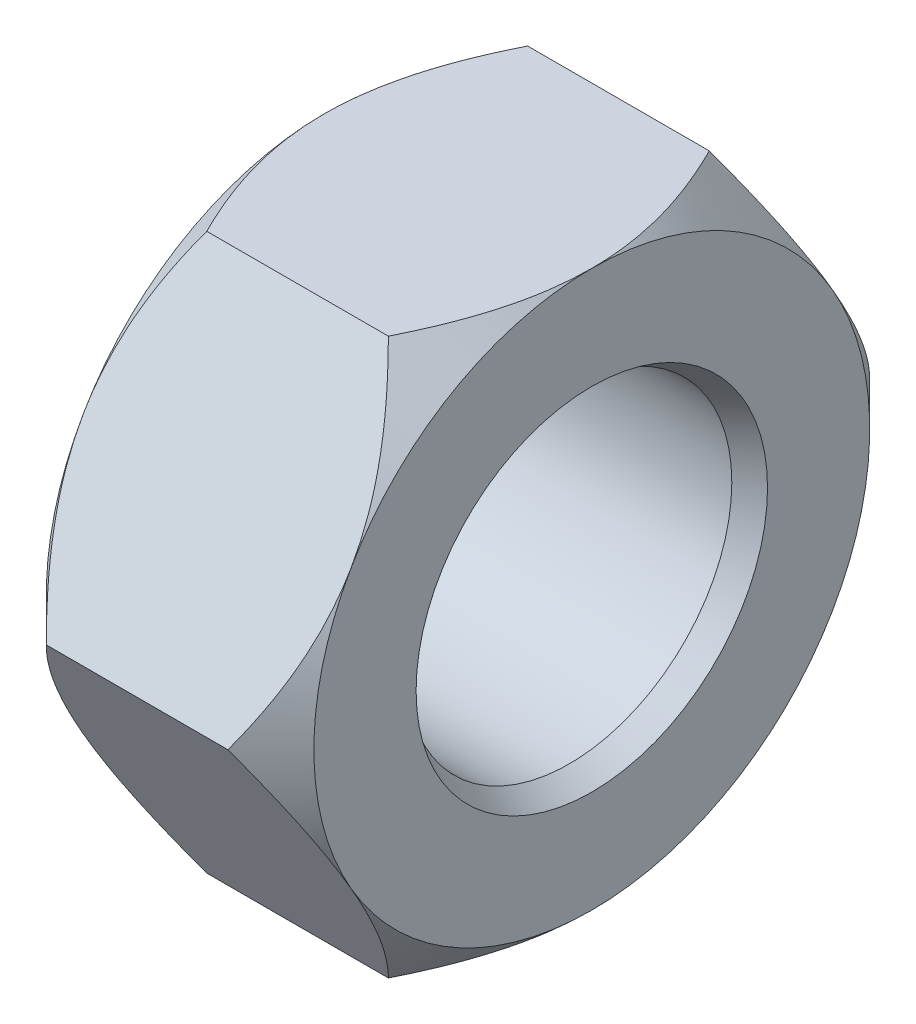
ISO-10303-21;
HEADER;
FILE_DESCRIPTION(('STEP AP214'),'2;1');
FILE_NAME('part.step','',(''),(''),'','','');
FILE_SCHEMA(('AUTOMOTIVE_DESIGN { 1 0 10303 214 1 1 1 1 }'));
ENDSEC;
DATA;
#1=APPLICATION_CONTEXT('core data for automotive mechanical design processes');
#2=APPLICATION_PROTOCOL_DEFINITION('international standard','automotive_design',2000,#1);
#3=PRODUCT_CONTEXT('',#1,'mechanical');
#4=PRODUCT('Part','Part','',(#3));
#5=PRODUCT_RELATED_PRODUCT_CATEGORY('part','',(#4));
#6=PRODUCT_DEFINITION_FORMATION('','',#4);
#7=PRODUCT_DEFINITION_CONTEXT('part definition',#1,'design');
#8=PRODUCT_DEFINITION('design','',#6,#7);
#9=PRODUCT_DEFINITION_SHAPE('','',#8);
#10=(LENGTH_UNIT() NAMED_UNIT(*) SI_UNIT(.MILLI.,.METRE.));
#11=(NAMED_UNIT(*) PLANE_ANGLE_UNIT() SI_UNIT($,.RADIAN.));
#12=(NAMED_UNIT(*) SI_UNIT($,.STERADIAN.) SOLID_ANGLE_UNIT());
#13=UNCERTAINTY_MEASURE_WITH_UNIT(LENGTH_MEASURE(1.E-05),#10,'distance_accuracy_value','');
#14=(GEOMETRIC_REPRESENTATION_CONTEXT(3) GLOBAL_UNCERTAINTY_ASSIGNED_CONTEXT((#13)) GLOBAL_UNIT_ASSIGNED_CONTEXT((#10,
#11,#12)) REPRESENTATION_CONTEXT('',''));
#15=CARTESIAN_POINT('',(0.,0.,0.));
#16=DIRECTION('',(0.,0.,1.));
#17=DIRECTION('',(1.,0.,0.));
#18=AXIS2_PLACEMENT_3D('',#15,#16,#17);
#19=CARTESIAN_POINT('',(5.00000000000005,0.,0.));
#20=DIRECTION('',(1.,0.,0.));
#21=DIRECTION('',(0.,0.,-1.));
#22=AXIS2_PLACEMENT_3D('',#19,#20,#21);
#23=CONICAL_SURFACE('',#22,18.5,0.785398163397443);
#24=CARTESIAN_POINT('',(8.57500740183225,-13.5,-17.4658510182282));
#25=CARTESIAN_POINT('',(8.40975452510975,-13.5,-17.2569852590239));
#26=CARTESIAN_POINT('',(8.24518004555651,-13.5,-17.0475831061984));
#27=CARTESIAN_POINT('',(7.9175209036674,-13.5,-16.6276118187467));
#28=CARTESIAN_POINT('',(7.75443626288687,-13.5,-16.4170426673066));
#29=CARTESIAN_POINT('',(7.26755832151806,-13.5,-15.7833673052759));
#30=CARTESIAN_POINT('',(6.94620776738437,-13.5,-15.358377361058));
#31=CARTESIAN_POINT('',(6.30897522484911,-13.5,-14.499281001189));
#32=CARTESIAN_POINT('',(5.99315346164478,-13.5,-14.0651298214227));
#33=CARTESIAN_POINT('',(5.37134468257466,-13.5,-13.1898645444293));
#34=CARTESIAN_POINT('',(5.06535701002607,-13.5,-12.7487509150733));
#35=CARTESIAN_POINT('',(4.44332117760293,-13.5,-11.8253043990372));
#36=CARTESIAN_POINT('',(4.12820744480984,-13.5,-11.3423390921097));
#37=CARTESIAN_POINT('',(3.51583266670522,-13.5,-10.3650217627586));
#38=CARTESIAN_POINT('',(3.21857490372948,-13.5,-9.87066766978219));
#39=CARTESIAN_POINT('',(2.64810934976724,-13.5,-8.87016835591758));
#40=CARTESIAN_POINT('',(2.37483154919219,-13.5,-8.36406331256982));
#41=CARTESIAN_POINT('',(1.85841694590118,-13.5,-7.33675869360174));
#42=CARTESIAN_POINT('',(1.61526507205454,-13.5,-6.81556682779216));
#43=CARTESIAN_POINT('',(1.29391852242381,-13.5,-6.05425939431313));
#44=CARTESIAN_POINT('',(1.19982775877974,-13.5,-5.82082745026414));
#45=CARTESIAN_POINT('',(1.02010004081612,-13.5,-5.35075169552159));
#46=CARTESIAN_POINT('',(0.934462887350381,-13.5,-5.11410796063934));
#47=CARTESIAN_POINT('',(0.691640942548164,-13.5,-4.39923792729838));
#48=CARTESIAN_POINT('',(0.548527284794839,-13.5,-3.91603009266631));
#49=CARTESIAN_POINT('',(0.369388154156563,-13.5,-3.18807150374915));
#50=CARTESIAN_POINT('',(0.31598901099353,-13.5,-2.94750401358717));
#51=CARTESIAN_POINT('',(0.220986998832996,-13.5,-2.46406209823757));
#52=CARTESIAN_POINT('',(0.179382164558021,-13.5,-2.22118806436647));
#53=CARTESIAN_POINT('',(0.108723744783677,-13.5,-1.73364747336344));
#54=CARTESIAN_POINT('',(0.0796685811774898,-13.5,-1.48898114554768));
#55=CARTESIAN_POINT('',(0.0346683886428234,-13.5,-0.998441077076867));
#56=CARTESIAN_POINT('',(0.0187230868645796,-13.5,-0.752567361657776));
#57=CARTESIAN_POINT('',(0.000804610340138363,-13.5,-0.274603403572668));
#58=CARTESIAN_POINT('',(-0.00192574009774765,-13.5,-0.0425413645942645));
#59=CARTESIAN_POINT('',(0.00458421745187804,-13.5,0.421440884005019));
#60=CARTESIAN_POINT('',(0.0138258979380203,-13.5,0.653361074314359));
#61=CARTESIAN_POINT('',(0.0441136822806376,-13.5,1.11641132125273));
#62=CARTESIAN_POINT('',(0.0651588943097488,-13.5,1.34754143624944));
#63=CARTESIAN_POINT('',(0.118669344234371,-13.5,1.80848735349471));
#64=CARTESIAN_POINT('',(0.151136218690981,-13.5,2.03830296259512));
#65=CARTESIAN_POINT('',(0.266335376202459,-13.5,2.73372438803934));
#66=CARTESIAN_POINT('',(0.366268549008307,-13.5,3.19656045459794));
#67=CARTESIAN_POINT('',(0.605339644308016,-13.5,4.11171328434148));
#68=CARTESIAN_POINT('',(0.74447721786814,-13.5,4.5640301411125));
#69=CARTESIAN_POINT('',(1.05699331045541,-13.5,5.46217190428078));
#70=CARTESIAN_POINT('',(1.230734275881,-13.5,5.90786927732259));
#71=CARTESIAN_POINT('',(1.6051849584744,-13.5,6.78788106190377));
#72=CARTESIAN_POINT('',(1.80590636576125,-13.5,7.22219044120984));
#73=CARTESIAN_POINT('',(2.22956318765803,-13.5,8.08141605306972));
#74=CARTESIAN_POINT('',(2.45256527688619,-13.5,8.50629914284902));
#75=CARTESIAN_POINT('',(2.91590033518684,-13.5,9.3463635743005));
#76=CARTESIAN_POINT('',(3.15623073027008,-13.5,9.76154634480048));
#77=CARTESIAN_POINT('',(3.63866389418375,-13.5,10.5631964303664));
#78=CARTESIAN_POINT('',(3.88009486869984,-13.5,10.950070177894));
#79=CARTESIAN_POINT('',(4.37332688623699,-13.5,11.7171692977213));
#80=CARTESIAN_POINT('',(4.62512869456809,-13.5,12.0973941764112));
#81=CARTESIAN_POINT('',(5.13523905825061,-13.5,12.8490412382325));
#82=CARTESIAN_POINT('',(5.39348026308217,-13.5,13.2205092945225));
#83=CARTESIAN_POINT('',(5.9169572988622,-13.5,13.9583359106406));
#84=CARTESIAN_POINT('',(6.18219118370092,-13.5,14.3246958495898));
#85=CARTESIAN_POINT('',(6.45029006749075,-13.5,14.688909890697));
#86=B_SPLINE_CURVE_WITH_KNOTS('',3,(#24,#25,#26,#27,#28,#29,#30,#31,#32,#33,#34,#35,#36,#37,#38,
#39,#40,#41,#42,#43,#44,#45,#46,#47,#48,#49,#50,#51,#52,#53,#54,#55,#56,#57,#58,#59,#60,#61,#62,
#63,#64,#65,#66,#67,#68,#69,#70,#71,#72,#73,#74,#75,#76,#77,#78,#79,#80,#81,#82,#83,#84,#85),
.UNSPECIFIED.,.F.,.F.,(4,2,2,2,2,2,2,2,2,2,2,2,2,2,2,2,2,2,2,2,2,2,2,2,2,2,2,2,2,2,4),(0.,
0.798997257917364,1.59800605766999,3.19634593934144,4.80684908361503,6.41724446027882,
8.1469605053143,9.87699354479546,11.6017949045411,13.3257298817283,14.0806257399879,
14.8355038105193,16.3451207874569,17.0841571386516,17.8230702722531,18.5618904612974,
19.300695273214,19.9966230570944,20.6926306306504,21.3885856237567,22.084640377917,
23.5029302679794,24.9212075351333,26.3552056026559,27.7898270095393,29.2288779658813,
30.6677156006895,32.0356018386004,33.4035892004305,34.7607391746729,36.1175153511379),.UNSPECIFIED.);
#87=CARTESIAN_POINT('',(2.08845726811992,-13.5,7.79422863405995));
#88=VERTEX_POINT('',#87);
#89=CARTESIAN_POINT('',(0.,-13.5,0.));
#90=VERTEX_POINT('',#89);
#91=EDGE_CURVE('E289',#88,#90,#86,.F.);
#92=ORIENTED_EDGE('',*,*,#91,.F.);
#93=CARTESIAN_POINT('',(2.08857273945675,0.000200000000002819,15.5885727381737));
#94=CARTESIAN_POINT('',(1.954593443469,-0.231893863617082,15.4545732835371));
#95=CARTESIAN_POINT('',(1.82470250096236,-0.465805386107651,15.3195244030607));
#96=CARTESIAN_POINT('',(1.57439597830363,-0.937546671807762,15.0471644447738));
#97=CARTESIAN_POINT('',(1.4539855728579,-1.17537849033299,14.9098521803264));
#98=CARTESIAN_POINT('',(1.22342885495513,-1.65636502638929,14.6321544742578));
#99=CARTESIAN_POINT('',(1.11334525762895,-1.89954242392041,14.4917559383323));
#100=CARTESIAN_POINT('',(0.90583303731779,-2.3898912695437,14.2086529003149));
#101=CARTESIAN_POINT('',(0.808402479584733,-2.6370621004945,14.0659487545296));
#102=CARTESIAN_POINT('',(0.629279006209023,-3.13142378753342,13.7805289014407));
#103=CARTESIAN_POINT('',(0.547363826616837,-3.37855389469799,13.6378482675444));
#104=CARTESIAN_POINT('',(0.399063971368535,-3.87627837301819,13.3504869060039));
#105=CARTESIAN_POINT('',(0.332677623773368,-4.12687236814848,13.2058063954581));
#106=CARTESIAN_POINT('',(0.217106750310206,-4.63045277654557,12.9150641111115));
#107=CARTESIAN_POINT('',(0.167883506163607,-4.88343246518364,12.7690062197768));
#108=CARTESIAN_POINT('',(0.0877204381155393,-5.39151563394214,12.4756642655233));
#109=CARTESIAN_POINT('',(0.056777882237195,-5.64661879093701,12.3283803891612));
#110=CARTESIAN_POINT('',(0.0048957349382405,-6.26828700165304,11.9694600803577));
#111=CARTESIAN_POINT('',(-0.00599145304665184,-6.63552399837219,11.7574357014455));
#112=CARTESIAN_POINT('',(0.0122840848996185,-7.3693337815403,11.3337704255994));
#113=CARTESIAN_POINT('',(0.0414608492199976,-7.7359062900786,11.1221296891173));
#114=CARTESIAN_POINT('',(0.138142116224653,-8.46559576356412,10.7008432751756));
#115=CARTESIAN_POINT('',(0.205689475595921,-8.82870840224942,10.4912000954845));
#116=CARTESIAN_POINT('',(0.375440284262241,-9.5486924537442,10.0755171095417));
#117=CARTESIAN_POINT('',(0.477641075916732,-9.90556434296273,9.8694770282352));
#118=CARTESIAN_POINT('',(0.687891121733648,-10.5390522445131,9.50373261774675));
#119=CARTESIAN_POINT('',(0.790409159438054,-10.8170714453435,9.3432181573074));
#120=CARTESIAN_POINT('',(1.01196439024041,-11.3681194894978,9.0250704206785));
#121=CARTESIAN_POINT('',(1.13100208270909,-11.6411481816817,8.86743723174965));
#122=CARTESIAN_POINT('',(1.38292856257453,-12.1813552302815,8.5555485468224));
#123=CARTESIAN_POINT('',(1.51577378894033,-12.4485489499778,8.40128418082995));
#124=CARTESIAN_POINT('',(1.79357153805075,-12.9779891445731,8.0956117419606));
#125=CARTESIAN_POINT('',(1.93851663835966,-13.2402385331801,7.94420198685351));
#126=CARTESIAN_POINT('',(2.08857273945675,-13.5002,7.79411316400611));
#127=B_SPLINE_CURVE_WITH_KNOTS('',3,(#93,#94,#95,#96,#97,#98,#99,#100,#101,#102,#103,#104,#105,
#106,#107,#108,#109,#110,#111,#112,#113,#114,#115,#116,#117,#118,#119,#120,#121,#122,#123,#124,
#125,#126),.UNSPECIFIED.,.F.,.F.,(4,2,2,2,2,2,2,2,2,2,2,2,2,2,2,2,4),(0.,0.898906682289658,
1.79830065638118,2.70284417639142,3.60724922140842,4.49751224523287,5.38767937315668,
6.27582517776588,7.16383821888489,8.4344203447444,9.70544779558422,10.9778976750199,
12.2502499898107,13.2607780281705,14.2713366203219,15.278798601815,16.2856470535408),.UNSPECIFIED.);
#128=CARTESIAN_POINT('',(0.,-6.75,11.6913429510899));
#129=VERTEX_POINT('',#128);
#130=EDGE_CURVE('E152',#129,#88,#127,.T.);
#131=ORIENTED_EDGE('',*,*,#130,.F.);
#132=CARTESIAN_POINT('',(0.,0.,0.));
#133=DIRECTION('',(-1.,0.,0.));
#134=DIRECTION('',(0.,0.,1.));
#135=AXIS2_PLACEMENT_3D('',#132,#133,#134);
#136=CIRCLE('',#135,13.5);
#137=EDGE_CURVE('E288',#90,#129,#136,.T.);
#138=ORIENTED_EDGE('',*,*,#137,.F.);
#139=EDGE_LOOP('',(#92,#131,#138));
#140=FACE_BOUND('',#139,.T.);
#141=ADVANCED_FACE('F33',(#140),#23,.T.);
#142=CARTESIAN_POINT('',(2.08845726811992,-13.5,-7.79422863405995));
#143=VERTEX_POINT('',#142);
#144=EDGE_CURVE('E209',#90,#143,#86,.F.);
#145=ORIENTED_EDGE('',*,*,#144,.F.);
#146=CARTESIAN_POINT('',(0.,-6.75,-11.6913429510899));
#147=VERTEX_POINT('',#146);
#148=EDGE_CURVE('E212',#147,#90,#136,.T.);
#149=ORIENTED_EDGE('',*,*,#148,.F.);
#150=CARTESIAN_POINT('',(2.08857273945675,-13.5002,-7.79411316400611));
#151=CARTESIAN_POINT('',(1.95459344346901,-13.2681061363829,-7.9281126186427));
#152=CARTESIAN_POINT('',(1.82470250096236,-13.0341946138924,-8.06316149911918));
#153=CARTESIAN_POINT('',(1.57439597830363,-12.5624533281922,-8.335521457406));
#154=CARTESIAN_POINT('',(1.4539855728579,-12.324621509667,-8.4728337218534));
#155=CARTESIAN_POINT('',(1.22342885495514,-11.8436349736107,-8.75053142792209));
#156=CARTESIAN_POINT('',(1.11334525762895,-11.6004575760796,-8.89092996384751));
#157=CARTESIAN_POINT('',(0.905833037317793,-11.1101087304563,-9.17403300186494));
#158=CARTESIAN_POINT('',(0.808402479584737,-10.8629378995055,-9.31673714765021));
#159=CARTESIAN_POINT('',(0.629279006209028,-10.3685762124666,-9.60215700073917));
#160=CARTESIAN_POINT('',(0.547363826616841,-10.121446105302,-9.74483763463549));
#161=CARTESIAN_POINT('',(0.399063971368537,-9.62372162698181,-10.0321989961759));
#162=CARTESIAN_POINT('',(0.332677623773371,-9.37312763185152,-10.1768795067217));
#163=CARTESIAN_POINT('',(0.21710675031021,-8.86954722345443,-10.4676217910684));
#164=CARTESIAN_POINT('',(0.167883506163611,-8.61656753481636,-10.6136796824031));
#165=CARTESIAN_POINT('',(0.0877204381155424,-8.10848436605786,-10.9070216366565));
#166=CARTESIAN_POINT('',(0.0567778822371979,-7.85338120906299,-11.0543055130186));
#167=CARTESIAN_POINT('',(0.00489573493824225,-7.23171299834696,-11.4132258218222));
#168=CARTESIAN_POINT('',(-0.00599145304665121,-6.86447600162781,-11.6252502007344));
#169=CARTESIAN_POINT('',(0.0122840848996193,-6.13066621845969,-12.0489154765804));
#170=CARTESIAN_POINT('',(0.0414608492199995,-5.7640937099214,-12.2605562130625));
#171=CARTESIAN_POINT('',(0.138142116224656,-5.03440423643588,-12.6818426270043));
#172=CARTESIAN_POINT('',(0.205689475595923,-4.67129159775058,-12.8914858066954));
#173=CARTESIAN_POINT('',(0.375440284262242,-3.9513075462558,-13.3071687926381));
#174=CARTESIAN_POINT('',(0.477641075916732,-3.59443565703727,-13.5132088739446));
#175=CARTESIAN_POINT('',(0.687891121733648,-2.96094775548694,-13.8789532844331));
#176=CARTESIAN_POINT('',(0.790409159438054,-2.68292855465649,-14.0394677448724));
#177=CARTESIAN_POINT('',(1.01196439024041,-2.13188051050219,-14.3576154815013));
#178=CARTESIAN_POINT('',(1.13100208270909,-1.85885181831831,-14.5152486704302));
#179=CARTESIAN_POINT('',(1.38292856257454,-1.31864476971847,-14.8271373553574));
#180=CARTESIAN_POINT('',(1.51577378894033,-1.05145105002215,-14.9814017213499));
#181=CARTESIAN_POINT('',(1.79357153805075,-0.52201085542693,-15.2870741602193));
#182=CARTESIAN_POINT('',(1.93851663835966,-0.259761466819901,-15.4384839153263));
#183=CARTESIAN_POINT('',(2.08857273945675,0.000200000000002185,-15.5885727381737));
#184=B_SPLINE_CURVE_WITH_KNOTS('',3,(#150,#151,#152,#153,#154,#155,#156,#157,#158,#159,#160,
#161,#162,#163,#164,#165,#166,#167,#168,#169,#170,#171,#172,#173,#174,#175,#176,#177,#178,#179,
#180,#181,#182,#183),.UNSPECIFIED.,.F.,.F.,(4,2,2,2,2,2,2,2,2,2,2,2,2,2,2,2,4),(0.,
0.898906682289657,1.79830065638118,2.70284417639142,3.60724922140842,4.49751224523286,
5.38767937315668,6.27582517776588,7.16383821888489,8.43442034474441,9.70544779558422,
10.9778976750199,12.2502499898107,13.2607780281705,14.2713366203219,15.278798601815,
16.2856470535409),.UNSPECIFIED.);
#185=EDGE_CURVE('E199',#143,#147,#184,.T.);
#186=ORIENTED_EDGE('',*,*,#185,.F.);
#187=EDGE_LOOP('',(#145,#149,#186));
#188=FACE_BOUND('',#187,.T.);
#189=ADVANCED_FACE('F208',(#188),#23,.T.);
#190=CARTESIAN_POINT('',(2.08845726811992,0.,-15.5884572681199));
#191=VERTEX_POINT('',#190);
#192=EDGE_CURVE('E215',#147,#191,#184,.T.);
#193=ORIENTED_EDGE('',*,*,#192,.F.);
#194=CARTESIAN_POINT('',(0.,6.75,-11.6913429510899));
#195=VERTEX_POINT('',#194);
#196=EDGE_CURVE('E297',#195,#147,#136,.T.);
#197=ORIENTED_EDGE('',*,*,#196,.F.);
#198=CARTESIAN_POINT('',(2.08857273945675,-0.000199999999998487,-15.5885727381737));
#199=CARTESIAN_POINT('',(1.95459344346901,0.231893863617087,-15.4545732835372));
#200=CARTESIAN_POINT('',(1.82470250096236,0.465805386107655,-15.3195244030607));
#201=CARTESIAN_POINT('',(1.57439597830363,0.937546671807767,-15.0471644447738));
#202=CARTESIAN_POINT('',(1.4539855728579,1.175378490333,-14.9098521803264));
#203=CARTESIAN_POINT('',(1.22342885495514,1.65636502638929,-14.6321544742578));
#204=CARTESIAN_POINT('',(1.11334525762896,1.89954242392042,-14.4917559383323));
#205=CARTESIAN_POINT('',(0.905833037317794,2.3898912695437,-14.2086529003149));
#206=CARTESIAN_POINT('',(0.808402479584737,2.6370621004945,-14.0659487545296));
#207=CARTESIAN_POINT('',(0.629279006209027,3.13142378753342,-13.7805289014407));
#208=CARTESIAN_POINT('',(0.547363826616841,3.37855389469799,-13.6378482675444));
#209=CARTESIAN_POINT('',(0.399063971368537,3.87627837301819,-13.3504869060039));
#210=CARTESIAN_POINT('',(0.33267762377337,4.12687236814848,-13.2058063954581));
#211=CARTESIAN_POINT('',(0.217106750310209,4.63045277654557,-12.9150641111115));
#212=CARTESIAN_POINT('',(0.167883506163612,4.88343246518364,-12.7690062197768));
#213=CARTESIAN_POINT('',(0.087720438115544,5.39151563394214,-12.4756642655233));
#214=CARTESIAN_POINT('',(0.0567778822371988,5.64661879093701,-12.3283803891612));
#215=CARTESIAN_POINT('',(0.00489573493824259,6.26828700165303,-11.9694600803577));
#216=CARTESIAN_POINT('',(-0.00599145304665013,6.63552399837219,-11.7574357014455));
#217=CARTESIAN_POINT('',(0.0122840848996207,7.3693337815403,-11.3337704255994));
#218=CARTESIAN_POINT('',(0.0414608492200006,7.73590629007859,-11.1221296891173));
#219=CARTESIAN_POINT('',(0.138142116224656,8.46559576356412,-10.7008432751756));
#220=CARTESIAN_POINT('',(0.205689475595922,8.82870840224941,-10.4912000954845));
#221=CARTESIAN_POINT('',(0.37544028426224,9.5486924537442,-10.0755171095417));
#222=CARTESIAN_POINT('',(0.477641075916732,9.90556434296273,-9.86947702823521));
#223=CARTESIAN_POINT('',(0.687891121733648,10.5390522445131,-9.50373261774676));
#224=CARTESIAN_POINT('',(0.790409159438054,10.8170714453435,-9.34321815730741));
#225=CARTESIAN_POINT('',(1.01196439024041,11.3681194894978,-9.02507042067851));
#226=CARTESIAN_POINT('',(1.13100208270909,11.6411481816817,-8.86743723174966));
#227=CARTESIAN_POINT('',(1.38292856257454,12.1813552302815,-8.5555485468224));
#228=CARTESIAN_POINT('',(1.51577378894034,12.4485489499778,-8.40128418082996));
#229=CARTESIAN_POINT('',(1.79357153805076,12.9779891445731,-8.0956117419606));
#230=CARTESIAN_POINT('',(1.93851663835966,13.2402385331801,-7.94420198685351));
#231=CARTESIAN_POINT('',(2.08857273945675,13.5002,-7.79411316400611));
#232=B_SPLINE_CURVE_WITH_KNOTS('',3,(#198,#199,#200,#201,#202,#203,#204,#205,#206,#207,#208,
#209,#210,#211,#212,#213,#214,#215,#216,#217,#218,#219,#220,#221,#222,#223,#224,#225,#226,#227,
#228,#229,#230,#231),.UNSPECIFIED.,.F.,.F.,(4,2,2,2,2,2,2,2,2,2,2,2,2,2,2,2,4),(0.,
0.898906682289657,1.79830065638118,2.70284417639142,3.60724922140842,4.49751224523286,
5.38767937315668,6.27582517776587,7.16383821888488,8.43442034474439,9.70544779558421,
10.9778976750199,12.2502499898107,13.2607780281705,14.2713366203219,15.278798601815,
16.2856470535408),.UNSPECIFIED.);
#233=EDGE_CURVE('E252',#191,#195,#232,.T.);
#234=ORIENTED_EDGE('',*,*,#233,.F.);
#235=EDGE_LOOP('',(#193,#197,#234));
#236=FACE_BOUND('',#235,.T.);
#237=ADVANCED_FACE('F355',(#236),#23,.T.);
#238=CARTESIAN_POINT('',(2.08845726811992,13.5,-7.79422863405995));
#239=VERTEX_POINT('',#238);
#240=EDGE_CURVE('E248',#195,#239,#232,.T.);
#241=ORIENTED_EDGE('',*,*,#240,.F.);
#242=CARTESIAN_POINT('',(0.,13.5,0.));
#243=VERTEX_POINT('',#242);
#244=EDGE_CURVE('E293',#243,#195,#136,.T.);
#245=ORIENTED_EDGE('',*,*,#244,.F.);
#246=CARTESIAN_POINT('',(8.57500740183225,13.5,-17.4658510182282));
#247=CARTESIAN_POINT('',(8.40975452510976,13.5,-17.2569852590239));
#248=CARTESIAN_POINT('',(8.24518004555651,13.5,-17.0475831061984));
#249=CARTESIAN_POINT('',(7.9175209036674,13.5,-16.6276118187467));
#250=CARTESIAN_POINT('',(7.75443626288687,13.5,-16.4170426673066));
#251=CARTESIAN_POINT('',(7.26755832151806,13.5,-15.7833673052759));
#252=CARTESIAN_POINT('',(6.94620776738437,13.5,-15.358377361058));
#253=CARTESIAN_POINT('',(6.30897522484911,13.5,-14.499281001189));
#254=CARTESIAN_POINT('',(5.99315346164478,13.5,-14.0651298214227));
#255=CARTESIAN_POINT('',(5.37134468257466,13.5,-13.1898645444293));
#256=CARTESIAN_POINT('',(5.06535701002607,13.5,-12.7487509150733));
#257=CARTESIAN_POINT('',(4.44332117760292,13.5,-11.8253043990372));
#258=CARTESIAN_POINT('',(4.12820744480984,13.5,-11.3423390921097));
#259=CARTESIAN_POINT('',(3.51583266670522,13.5,-10.3650217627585));
#260=CARTESIAN_POINT('',(3.21857490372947,13.5,-9.87066766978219));
#261=CARTESIAN_POINT('',(2.64810934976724,13.5,-8.87016835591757));
#262=CARTESIAN_POINT('',(2.37483154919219,13.5,-8.36406331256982));
#263=CARTESIAN_POINT('',(1.85841694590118,13.5,-7.33675869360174));
#264=CARTESIAN_POINT('',(1.61526507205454,13.5,-6.81556682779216));
#265=CARTESIAN_POINT('',(1.29391852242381,13.5,-6.05425939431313));
#266=CARTESIAN_POINT('',(1.19982775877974,13.5,-5.82082745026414));
#267=CARTESIAN_POINT('',(1.02010004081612,13.5,-5.35075169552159));
#268=CARTESIAN_POINT('',(0.934462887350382,13.5,-5.11410796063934));
#269=CARTESIAN_POINT('',(0.691640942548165,13.5,-4.39923792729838));
#270=CARTESIAN_POINT('',(0.548527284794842,13.5,-3.91603009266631));
#271=CARTESIAN_POINT('',(0.369388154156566,13.5,-3.18807150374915));
#272=CARTESIAN_POINT('',(0.315989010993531,13.5,-2.94750401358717));
#273=CARTESIAN_POINT('',(0.220986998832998,13.5,-2.46406209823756));
#274=CARTESIAN_POINT('',(0.179382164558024,13.5,-2.22118806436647));
#275=CARTESIAN_POINT('',(0.10872374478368,13.5,-1.73364747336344));
#276=CARTESIAN_POINT('',(0.0796685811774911,13.5,-1.48898114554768));
#277=CARTESIAN_POINT('',(0.0346683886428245,13.5,-0.998441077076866));
#278=CARTESIAN_POINT('',(0.0187230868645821,13.5,-0.752567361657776));
#279=CARTESIAN_POINT('',(0.000804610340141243,13.5,-0.274603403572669));
#280=CARTESIAN_POINT('',(-0.00192574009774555,13.5,-0.0425413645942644));
#281=CARTESIAN_POINT('',(0.00458421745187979,13.5,0.421440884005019));
#282=CARTESIAN_POINT('',(0.0138258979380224,13.5,0.653361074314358));
#283=CARTESIAN_POINT('',(0.0441136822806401,13.5,1.11641132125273));
#284=CARTESIAN_POINT('',(0.0651588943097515,13.5,1.34754143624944));
#285=CARTESIAN_POINT('',(0.118669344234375,13.5,1.80848735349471));
#286=CARTESIAN_POINT('',(0.151136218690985,13.5,2.03830296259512));
#287=CARTESIAN_POINT('',(0.266335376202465,13.5,2.73372438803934));
#288=CARTESIAN_POINT('',(0.366268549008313,13.5,3.19656045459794));
#289=CARTESIAN_POINT('',(0.605339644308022,13.5,4.11171328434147));
#290=CARTESIAN_POINT('',(0.744477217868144,13.5,4.5640301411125));
#291=CARTESIAN_POINT('',(1.05699331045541,13.5,5.46217190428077));
#292=CARTESIAN_POINT('',(1.23073427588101,13.5,5.90786927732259));
#293=CARTESIAN_POINT('',(1.6051849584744,13.5,6.78788106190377));
#294=CARTESIAN_POINT('',(1.80590636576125,13.5,7.22219044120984));
#295=CARTESIAN_POINT('',(2.22956318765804,13.5,8.08141605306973));
#296=CARTESIAN_POINT('',(2.45256527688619,13.5,8.50629914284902));
#297=CARTESIAN_POINT('',(2.91590033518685,13.5,9.3463635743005));
#298=CARTESIAN_POINT('',(3.15623073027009,13.5,9.76154634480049));
#299=CARTESIAN_POINT('',(3.63866389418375,13.5,10.5631964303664));
#300=CARTESIAN_POINT('',(3.88009486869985,13.5,10.950070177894));
#301=CARTESIAN_POINT('',(4.373326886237,13.5,11.7171692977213));
#302=CARTESIAN_POINT('',(4.62512869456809,13.5,12.0973941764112));
#303=CARTESIAN_POINT('',(5.13523905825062,13.5,12.8490412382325));
#304=CARTESIAN_POINT('',(5.39348026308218,13.5,13.2205092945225));
#305=CARTESIAN_POINT('',(5.91695729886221,13.5,13.9583359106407));
#306=CARTESIAN_POINT('',(6.18219118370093,13.5,14.3246958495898));
#307=CARTESIAN_POINT('',(6.45029006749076,13.5,14.688909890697));
#308=B_SPLINE_CURVE_WITH_KNOTS('',3,(#246,#247,#248,#249,#250,#251,#252,#253,#254,#255,#256,
#257,#258,#259,#260,#261,#262,#263,#264,#265,#266,#267,#268,#269,#270,#271,#272,#273,#274,#275,
#276,#277,#278,#279,#280,#281,#282,#283,#284,#285,#286,#287,#288,#289,#290,#291,#292,#293,#294,
#295,#296,#297,#298,#299,#300,#301,#302,#303,#304,#305,#306,#307),.UNSPECIFIED.,.F.,.F.,(4,2,2,
2,2,2,2,2,2,2,2,2,2,2,2,2,2,2,2,2,2,2,2,2,2,2,2,2,2,2,4),(0.,0.798997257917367,1.59800605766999,
3.19634593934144,4.80684908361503,6.41724446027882,8.14696050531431,9.87699354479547,
11.6017949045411,13.3257298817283,14.0806257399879,14.8355038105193,16.3451207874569,
17.0841571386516,17.8230702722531,18.5618904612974,19.300695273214,19.9966230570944,
20.6926306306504,21.3885856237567,22.084640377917,23.5029302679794,24.9212075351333,
26.3552056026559,27.7898270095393,29.2288779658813,30.6677156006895,32.0356018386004,
33.4035892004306,34.7607391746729,36.1175153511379),.UNSPECIFIED.);
#309=EDGE_CURVE('E258',#239,#243,#308,.T.);
#310=ORIENTED_EDGE('',*,*,#309,.F.);
#311=EDGE_LOOP('',(#241,#245,#310));
#312=FACE_BOUND('',#311,.T.);
#313=ADVANCED_FACE('F357',(#312),#23,.T.);
#314=CARTESIAN_POINT('',(2.08845726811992,13.5,7.79422863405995));
#315=VERTEX_POINT('',#314);
#316=EDGE_CURVE('E260',#243,#315,#308,.T.);
#317=ORIENTED_EDGE('',*,*,#316,.F.);
#318=CARTESIAN_POINT('',(0.,6.75,11.6913429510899));
#319=VERTEX_POINT('',#318);
#320=EDGE_CURVE('E287',#319,#243,#136,.T.);
#321=ORIENTED_EDGE('',*,*,#320,.F.);
#322=CARTESIAN_POINT('',(2.08857273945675,13.5002,7.79411316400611));
#323=CARTESIAN_POINT('',(1.95459344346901,13.2681061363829,7.9281126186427));
#324=CARTESIAN_POINT('',(1.82470250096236,13.0341946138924,8.06316149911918));
#325=CARTESIAN_POINT('',(1.57439597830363,12.5624533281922,8.335521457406));
#326=CARTESIAN_POINT('',(1.4539855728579,12.324621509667,8.4728337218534));
#327=CARTESIAN_POINT('',(1.22342885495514,11.8436349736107,8.75053142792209));
#328=CARTESIAN_POINT('',(1.11334525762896,11.6004575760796,8.89092996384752));
#329=CARTESIAN_POINT('',(0.905833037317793,11.1101087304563,9.17403300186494));
#330=CARTESIAN_POINT('',(0.808402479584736,10.8629378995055,9.31673714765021));
#331=CARTESIAN_POINT('',(0.629279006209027,10.3685762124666,9.60215700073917));
#332=CARTESIAN_POINT('',(0.54736382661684,10.121446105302,9.74483763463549));
#333=CARTESIAN_POINT('',(0.399063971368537,9.62372162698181,10.0321989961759));
#334=CARTESIAN_POINT('',(0.33267762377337,9.37312763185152,10.1768795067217));
#335=CARTESIAN_POINT('',(0.21710675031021,8.86954722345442,10.4676217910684));
#336=CARTESIAN_POINT('',(0.167883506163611,8.61656753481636,10.6136796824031));
#337=CARTESIAN_POINT('',(0.0877204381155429,8.10848436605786,10.9070216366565));
#338=CARTESIAN_POINT('',(0.0567778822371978,7.85338120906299,11.0543055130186));
#339=CARTESIAN_POINT('',(0.0048957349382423,7.23171299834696,11.4132258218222));
#340=CARTESIAN_POINT('',(-0.00599145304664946,6.8644760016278,11.6252502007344));
#341=CARTESIAN_POINT('',(0.0122840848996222,6.13066621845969,12.0489154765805));
#342=CARTESIAN_POINT('',(0.0414608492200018,5.7640937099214,12.2605562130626));
#343=CARTESIAN_POINT('',(0.138142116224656,5.03440423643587,12.6818426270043));
#344=CARTESIAN_POINT('',(0.205689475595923,4.67129159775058,12.8914858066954));
#345=CARTESIAN_POINT('',(0.375440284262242,3.95130754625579,13.3071687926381));
#346=CARTESIAN_POINT('',(0.477641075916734,3.59443565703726,13.5132088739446));
#347=CARTESIAN_POINT('',(0.687891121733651,2.96094775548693,13.8789532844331));
#348=CARTESIAN_POINT('',(0.790409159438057,2.68292855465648,14.0394677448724));
#349=CARTESIAN_POINT('',(1.01196439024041,2.13188051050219,14.3576154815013));
#350=CARTESIAN_POINT('',(1.13100208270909,1.85885181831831,14.5152486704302));
#351=CARTESIAN_POINT('',(1.38292856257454,1.31864476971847,14.8271373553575));
#352=CARTESIAN_POINT('',(1.51577378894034,1.05145105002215,14.9814017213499));
#353=CARTESIAN_POINT('',(1.79357153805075,0.522010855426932,15.2870741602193));
#354=CARTESIAN_POINT('',(1.93851663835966,0.259761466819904,15.4384839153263));
#355=CARTESIAN_POINT('',(2.08857273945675,-0.000199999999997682,15.5885727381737));
#356=B_SPLINE_CURVE_WITH_KNOTS('',3,(#322,#323,#324,#325,#326,#327,#328,#329,#330,#331,#332,
#333,#334,#335,#336,#337,#338,#339,#340,#341,#342,#343,#344,#345,#346,#347,#348,#349,#350,#351,
#352,#353,#354,#355),.UNSPECIFIED.,.F.,.F.,(4,2,2,2,2,2,2,2,2,2,2,2,2,2,2,2,4),(0.,
0.898906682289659,1.79830065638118,2.70284417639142,3.60724922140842,4.49751224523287,
5.38767937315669,6.27582517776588,7.16383821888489,8.43442034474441,9.70544779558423,
10.9778976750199,12.2502499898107,13.2607780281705,14.2713366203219,15.278798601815,
16.2856470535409),.UNSPECIFIED.);
#357=EDGE_CURVE('E144',#315,#319,#356,.T.);
#358=ORIENTED_EDGE('',*,*,#357,.F.);
#359=EDGE_LOOP('',(#317,#321,#358));
#360=FACE_BOUND('',#359,.T.);
#361=ADVANCED_FACE('F291',(#360),#23,.T.);
#362=CARTESIAN_POINT('',(2.08845726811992,0.,15.5884572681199));
#363=VERTEX_POINT('',#362);
#364=EDGE_CURVE('E135',#319,#363,#356,.T.);
#365=ORIENTED_EDGE('',*,*,#364,.F.);
#366=EDGE_CURVE('E281',#129,#319,#136,.T.);
#367=ORIENTED_EDGE('',*,*,#366,.F.);
#368=EDGE_CURVE('E55',#363,#129,#127,.T.);
#369=ORIENTED_EDGE('',*,*,#368,.F.);
#370=EDGE_LOOP('',(#365,#367,#369));
#371=FACE_BOUND('',#370,.T.);
#372=ADVANCED_FACE('F280',(#371),#23,.T.);
#373=CARTESIAN_POINT('',(13.,0.,0.));
#374=DIRECTION('',(-1.,0.,0.));
#375=DIRECTION('',(0.,0.,1.));
#376=AXIS2_PLACEMENT_3D('',#373,#374,#375);
#377=CONICAL_SURFACE('',#376,13.5,0.785398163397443);
#378=CARTESIAN_POINT('',(10.9114272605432,13.5002,-7.79411316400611));
#379=CARTESIAN_POINT('',(11.045406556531,13.2681061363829,-7.9281126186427));
#380=CARTESIAN_POINT('',(11.1752974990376,13.0341946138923,-8.06316149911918));
#381=CARTESIAN_POINT('',(11.4256040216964,12.5624533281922,-8.335521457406));
#382=CARTESIAN_POINT('',(11.5460144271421,12.324621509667,-8.4728337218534));
#383=CARTESIAN_POINT('',(11.7765711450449,11.8436349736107,-8.75053142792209));
#384=CARTESIAN_POINT('',(11.886654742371,11.6004575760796,-8.89092996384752));
#385=CARTESIAN_POINT('',(12.0941669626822,11.1101087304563,-9.17403300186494));
#386=CARTESIAN_POINT('',(12.1915975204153,10.8629378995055,-9.31673714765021));
#387=CARTESIAN_POINT('',(12.370720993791,10.3685762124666,-9.60215700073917));
#388=CARTESIAN_POINT('',(12.4526361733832,10.121446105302,-9.74483763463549));
#389=CARTESIAN_POINT('',(12.6009360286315,9.62372162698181,-10.0321989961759));
#390=CARTESIAN_POINT('',(12.6673223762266,9.37312763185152,-10.1768795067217));
#391=CARTESIAN_POINT('',(12.7828932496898,8.86954722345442,-10.4676217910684));
#392=CARTESIAN_POINT('',(12.8321164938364,8.61656753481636,-10.6136796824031));
#393=CARTESIAN_POINT('',(12.9122795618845,8.10848436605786,-10.9070216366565));
#394=CARTESIAN_POINT('',(12.9432221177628,7.85338120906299,-11.0543055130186));
#395=CARTESIAN_POINT('',(12.9951042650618,7.23171299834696,-11.4132258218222));
#396=CARTESIAN_POINT('',(13.0059914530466,6.86447600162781,-11.6252502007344));
#397=CARTESIAN_POINT('',(12.9877159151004,6.1306662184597,-12.0489154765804));
#398=CARTESIAN_POINT('',(12.95853915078,5.76409370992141,-12.2605562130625));
#399=CARTESIAN_POINT('',(12.8618578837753,5.03440423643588,-12.6818426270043));
#400=CARTESIAN_POINT('',(12.7943105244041,4.67129159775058,-12.8914858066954));
#401=CARTESIAN_POINT('',(12.6245597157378,3.9513075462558,-13.3071687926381));
#402=CARTESIAN_POINT('',(12.5223589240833,3.59443565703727,-13.5132088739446));
#403=CARTESIAN_POINT('',(12.3121088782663,2.96094775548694,-13.8789532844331));
#404=CARTESIAN_POINT('',(12.2095908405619,2.68292855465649,-14.0394677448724));
#405=CARTESIAN_POINT('',(11.9880356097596,2.13188051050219,-14.3576154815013));
#406=CARTESIAN_POINT('',(11.8689979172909,1.85885181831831,-14.5152486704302));
#407=CARTESIAN_POINT('',(11.6170714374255,1.31864476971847,-14.8271373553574));
#408=CARTESIAN_POINT('',(11.4842262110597,1.05145105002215,-14.9814017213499));
#409=CARTESIAN_POINT('',(11.2064284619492,0.522010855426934,-15.2870741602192));
#410=CARTESIAN_POINT('',(11.0614833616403,0.259761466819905,-15.4384839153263));
#411=CARTESIAN_POINT('',(10.9114272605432,-0.000199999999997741,-15.5885727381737));
#412=B_SPLINE_CURVE_WITH_KNOTS('',3,(#378,#379,#380,#381,#382,#383,#384,#385,#386,#387,#388,
#389,#390,#391,#392,#393,#394,#395,#396,#397,#398,#399,#400,#401,#402,#403,#404,#405,#406,#407,
#408,#409,#410,#411),.UNSPECIFIED.,.F.,.F.,(4,2,2,2,2,2,2,2,2,2,2,2,2,2,2,2,4),(0.,
0.898906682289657,1.79830065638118,2.70284417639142,3.60724922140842,4.49751224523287,
5.38767937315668,6.27582517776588,7.16383821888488,8.4344203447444,9.70544779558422,
10.9778976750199,12.2502499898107,13.2607780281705,14.2713366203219,15.278798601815,
16.2856470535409),.UNSPECIFIED.);
#413=CARTESIAN_POINT('',(10.9115427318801,13.5,-7.79422863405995));
#414=VERTEX_POINT('',#413);
#415=CARTESIAN_POINT('',(13.,6.75,-11.6913429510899));
#416=VERTEX_POINT('',#415);
#417=EDGE_CURVE('E253',#414,#416,#412,.T.);
#418=ORIENTED_EDGE('',*,*,#417,.F.);
#419=CARTESIAN_POINT('',(4.42499259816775,13.5,-17.4658510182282));
#420=CARTESIAN_POINT('',(4.59024547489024,13.5,-17.2569852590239));
#421=CARTESIAN_POINT('',(4.75481995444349,13.5,-17.0475831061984));
#422=CARTESIAN_POINT('',(5.0824790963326,13.5,-16.6276118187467));
#423=CARTESIAN_POINT('',(5.24556373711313,13.5,-16.4170426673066));
#424=CARTESIAN_POINT('',(5.73244167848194,13.5,-15.7833673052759));
#425=CARTESIAN_POINT('',(6.05379223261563,13.5,-15.358377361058));
#426=CARTESIAN_POINT('',(6.69102477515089,13.5,-14.499281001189));
#427=CARTESIAN_POINT('',(7.00684653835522,13.5,-14.0651298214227));
#428=CARTESIAN_POINT('',(7.62865531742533,13.5,-13.1898645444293));
#429=CARTESIAN_POINT('',(7.93464298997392,13.5,-12.7487509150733));
#430=CARTESIAN_POINT('',(8.55667882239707,13.5,-11.8253043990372));
#431=CARTESIAN_POINT('',(8.87179255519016,13.5,-11.3423390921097));
#432=CARTESIAN_POINT('',(9.48416733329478,13.5,-10.3650217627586));
#433=CARTESIAN_POINT('',(9.78142509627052,13.5,-9.8706676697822));
#434=CARTESIAN_POINT('',(10.3518906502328,13.5,-8.87016835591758));
#435=CARTESIAN_POINT('',(10.6251684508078,13.5,-8.36406331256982));
#436=CARTESIAN_POINT('',(11.1415830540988,13.5,-7.33675869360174));
#437=CARTESIAN_POINT('',(11.3847349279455,13.5,-6.81556682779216));
#438=CARTESIAN_POINT('',(11.7060814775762,13.5,-6.05425939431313));
#439=CARTESIAN_POINT('',(11.8001722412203,13.5,-5.82082745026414));
#440=CARTESIAN_POINT('',(11.9798999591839,13.5,-5.35075169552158));
#441=CARTESIAN_POINT('',(12.0655371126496,13.5,-5.11410796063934));
#442=CARTESIAN_POINT('',(12.3083590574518,13.5,-4.39923792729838));
#443=CARTESIAN_POINT('',(12.4514727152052,13.5,-3.91603009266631));
#444=CARTESIAN_POINT('',(12.6306118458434,13.5,-3.18807150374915));
#445=CARTESIAN_POINT('',(12.6840109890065,13.5,-2.94750401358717));
#446=CARTESIAN_POINT('',(12.779013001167,13.5,-2.46406209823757));
#447=CARTESIAN_POINT('',(12.820617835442,13.5,-2.22118806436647));
#448=CARTESIAN_POINT('',(12.8912762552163,13.5,-1.73364747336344));
#449=CARTESIAN_POINT('',(12.9203314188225,13.5,-1.48898114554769));
#450=CARTESIAN_POINT('',(12.9653316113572,13.5,-0.998441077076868));
#451=CARTESIAN_POINT('',(12.9812769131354,13.5,-0.752567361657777));
#452=CARTESIAN_POINT('',(12.9991953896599,13.5,-0.274603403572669));
#453=CARTESIAN_POINT('',(13.0019257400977,13.5,-0.0425413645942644));
#454=CARTESIAN_POINT('',(12.9954157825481,13.5,0.421440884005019));
#455=CARTESIAN_POINT('',(12.986174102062,13.5,0.653361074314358));
#456=CARTESIAN_POINT('',(12.9558863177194,13.5,1.11641132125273));
#457=CARTESIAN_POINT('',(12.9348411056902,13.5,1.34754143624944));
#458=CARTESIAN_POINT('',(12.8813306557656,13.5,1.80848735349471));
#459=CARTESIAN_POINT('',(12.848863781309,13.5,2.03830296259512));
#460=CARTESIAN_POINT('',(12.7336646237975,13.5,2.73372438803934));
#461=CARTESIAN_POINT('',(12.6337314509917,13.5,3.19656045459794));
#462=CARTESIAN_POINT('',(12.394660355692,13.5,4.11171328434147));
#463=CARTESIAN_POINT('',(12.2555227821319,13.5,4.5640301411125));
#464=CARTESIAN_POINT('',(11.9430066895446,13.5,5.46217190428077));
#465=CARTESIAN_POINT('',(11.769265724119,13.5,5.90786927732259));
#466=CARTESIAN_POINT('',(11.3948150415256,13.5,6.78788106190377));
#467=CARTESIAN_POINT('',(11.1940936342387,13.5,7.22219044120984));
#468=CARTESIAN_POINT('',(10.770436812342,13.5,8.08141605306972));
#469=CARTESIAN_POINT('',(10.5474347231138,13.5,8.50629914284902));
#470=CARTESIAN_POINT('',(10.0840996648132,13.5,9.3463635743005));
#471=CARTESIAN_POINT('',(9.84376926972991,13.5,9.76154634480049));
#472=CARTESIAN_POINT('',(9.36133610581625,13.5,10.5631964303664));
#473=CARTESIAN_POINT('',(9.11990513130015,13.5,10.950070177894));
#474=CARTESIAN_POINT('',(8.626673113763,13.5,11.7171692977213));
#475=CARTESIAN_POINT('',(8.3748713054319,13.5,12.0973941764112));
#476=CARTESIAN_POINT('',(7.86476094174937,13.5,12.8490412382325));
#477=CARTESIAN_POINT('',(7.60651973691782,13.5,13.2205092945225));
#478=CARTESIAN_POINT('',(7.08304270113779,13.5,13.9583359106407));
#479=CARTESIAN_POINT('',(6.81780881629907,13.5,14.3246958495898));
#480=CARTESIAN_POINT('',(6.54970993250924,13.5,14.688909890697));
#481=B_SPLINE_CURVE_WITH_KNOTS('',3,(#419,#420,#421,#422,#423,#424,#425,#426,#427,#428,#429,
#430,#431,#432,#433,#434,#435,#436,#437,#438,#439,#440,#441,#442,#443,#444,#445,#446,#447,#448,
#449,#450,#451,#452,#453,#454,#455,#456,#457,#458,#459,#460,#461,#462,#463,#464,#465,#466,#467,
#468,#469,#470,#471,#472,#473,#474,#475,#476,#477,#478,#479,#480),.UNSPECIFIED.,.F.,.F.,(4,2,2,
2,2,2,2,2,2,2,2,2,2,2,2,2,2,2,2,2,2,2,2,2,2,2,2,2,2,2,4),(0.,0.798997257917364,1.59800605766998,
3.19634593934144,4.80684908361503,6.41724446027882,8.1469605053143,9.87699354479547,
11.6017949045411,13.3257298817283,14.0806257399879,14.8355038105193,16.3451207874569,
17.0841571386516,17.8230702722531,18.5618904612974,19.300695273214,19.9966230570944,
20.6926306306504,21.3885856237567,22.084640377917,23.5029302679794,24.9212075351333,
26.3552056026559,27.7898270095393,29.2288779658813,30.6677156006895,32.0356018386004,
33.4035892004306,34.7607391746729,36.1175153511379),.UNSPECIFIED.);
#482=CARTESIAN_POINT('',(13.,13.5,0.));
#483=VERTEX_POINT('',#482);
#484=EDGE_CURVE('E268',#483,#414,#481,.F.);
#485=ORIENTED_EDGE('',*,*,#484,.F.);
#486=CARTESIAN_POINT('',(13.,0.,0.));
#487=DIRECTION('',(-1.,0.,0.));
#488=DIRECTION('',(0.,0.,1.));
#489=AXIS2_PLACEMENT_3D('',#486,#487,#488);
#490=CIRCLE('',#489,13.5);
#491=EDGE_CURVE('E304',#483,#416,#490,.T.);
#492=ORIENTED_EDGE('',*,*,#491,.T.);
#493=EDGE_LOOP('',(#418,#485,#492));
#494=FACE_BOUND('',#493,.T.);
#495=ADVANCED_FACE('F162',(#494),#377,.T.);
#496=CARTESIAN_POINT('',(10.9115427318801,0.,-15.5884572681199));
#497=VERTEX_POINT('',#496);
#498=EDGE_CURVE('E243',#416,#497,#412,.T.);
#499=ORIENTED_EDGE('',*,*,#498,.F.);
#500=CARTESIAN_POINT('',(13.,-6.75,-11.6913429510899));
#501=VERTEX_POINT('',#500);
#502=EDGE_CURVE('E339',#416,#501,#490,.T.);
#503=ORIENTED_EDGE('',*,*,#502,.T.);
#504=CARTESIAN_POINT('',(10.9114272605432,0.000200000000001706,-15.5885727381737));
#505=CARTESIAN_POINT('',(11.045406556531,-0.231893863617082,-15.4545732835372));
#506=CARTESIAN_POINT('',(11.1752974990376,-0.46580538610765,-15.3195244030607));
#507=CARTESIAN_POINT('',(11.4256040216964,-0.937546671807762,-15.0471644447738));
#508=CARTESIAN_POINT('',(11.5460144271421,-1.17537849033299,-14.9098521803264));
#509=CARTESIAN_POINT('',(11.7765711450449,-1.65636502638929,-14.6321544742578));
#510=CARTESIAN_POINT('',(11.886654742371,-1.89954242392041,-14.4917559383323));
#511=CARTESIAN_POINT('',(12.0941669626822,-2.3898912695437,-14.2086529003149));
#512=CARTESIAN_POINT('',(12.1915975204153,-2.6370621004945,-14.0659487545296));
#513=CARTESIAN_POINT('',(12.370720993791,-3.13142378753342,-13.7805289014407));
#514=CARTESIAN_POINT('',(12.4526361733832,-3.37855389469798,-13.6378482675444));
#515=CARTESIAN_POINT('',(12.6009360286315,-3.87627837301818,-13.3504869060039));
#516=CARTESIAN_POINT('',(12.6673223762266,-4.12687236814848,-13.2058063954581));
#517=CARTESIAN_POINT('',(12.7828932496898,-4.63045277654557,-12.9150641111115));
#518=CARTESIAN_POINT('',(12.8321164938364,-4.88343246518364,-12.7690062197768));
#519=CARTESIAN_POINT('',(12.9122795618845,-5.39151563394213,-12.4756642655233));
#520=CARTESIAN_POINT('',(12.9432221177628,-5.64661879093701,-12.3283803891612));
#521=CARTESIAN_POINT('',(12.9951042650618,-6.26828700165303,-11.9694600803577));
#522=CARTESIAN_POINT('',(13.0059914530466,-6.63552399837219,-11.7574357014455));
#523=CARTESIAN_POINT('',(12.9877159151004,-7.3693337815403,-11.3337704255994));
#524=CARTESIAN_POINT('',(12.95853915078,-7.73590629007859,-11.1221296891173));
#525=CARTESIAN_POINT('',(12.8618578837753,-8.46559576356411,-10.7008432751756));
#526=CARTESIAN_POINT('',(12.7943105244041,-8.82870840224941,-10.4912000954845));
#527=CARTESIAN_POINT('',(12.6245597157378,-9.5486924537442,-10.0755171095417));
#528=CARTESIAN_POINT('',(12.5223589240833,-9.90556434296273,-9.86947702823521));
#529=CARTESIAN_POINT('',(12.3121088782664,-10.5390522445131,-9.50373261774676));
#530=CARTESIAN_POINT('',(12.2095908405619,-10.8170714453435,-9.34321815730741));
#531=CARTESIAN_POINT('',(11.9880356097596,-11.3681194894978,-9.02507042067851));
#532=CARTESIAN_POINT('',(11.8689979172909,-11.6411481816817,-8.86743723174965));
#533=CARTESIAN_POINT('',(11.6170714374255,-12.1813552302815,-8.5555485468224));
#534=CARTESIAN_POINT('',(11.4842262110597,-12.4485489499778,-8.40128418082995));
#535=CARTESIAN_POINT('',(11.2064284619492,-12.9779891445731,-8.09561174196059));
#536=CARTESIAN_POINT('',(11.0614833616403,-13.2402385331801,-7.94420198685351));
#537=CARTESIAN_POINT('',(10.9114272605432,-13.5002,-7.79411316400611));
#538=B_SPLINE_CURVE_WITH_KNOTS('',3,(#504,#505,#506,#507,#508,#509,#510,#511,#512,#513,#514,
#515,#516,#517,#518,#519,#520,#521,#522,#523,#524,#525,#526,#527,#528,#529,#530,#531,#532,#533,
#534,#535,#536,#537),.UNSPECIFIED.,.F.,.F.,(4,2,2,2,2,2,2,2,2,2,2,2,2,2,2,2,4),(0.,
0.898906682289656,1.79830065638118,2.70284417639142,3.60724922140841,4.49751224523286,
5.38767937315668,6.27582517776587,7.16383821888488,8.4344203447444,9.70544779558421,
10.9778976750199,12.2502499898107,13.2607780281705,14.2713366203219,15.278798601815,
16.2856470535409),.UNSPECIFIED.);
#539=EDGE_CURVE('E219',#497,#501,#538,.T.);
#540=ORIENTED_EDGE('',*,*,#539,.F.);
#541=EDGE_LOOP('',(#499,#503,#540));
#542=FACE_BOUND('',#541,.T.);
#543=ADVANCED_FACE('F371',(#542),#377,.T.);
#544=CARTESIAN_POINT('',(10.9115427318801,-13.5,-7.79422863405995));
#545=VERTEX_POINT('',#544);
#546=EDGE_CURVE('E202',#501,#545,#538,.T.);
#547=ORIENTED_EDGE('',*,*,#546,.F.);
#548=CARTESIAN_POINT('',(13.,-13.5,0.));
#549=VERTEX_POINT('',#548);
#550=EDGE_CURVE('E341',#501,#549,#490,.T.);
#551=ORIENTED_EDGE('',*,*,#550,.T.);
#552=CARTESIAN_POINT('',(4.42499259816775,-13.5,-17.4658510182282));
#553=CARTESIAN_POINT('',(4.59024547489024,-13.5,-17.2569852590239));
#554=CARTESIAN_POINT('',(4.75481995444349,-13.5,-17.0475831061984));
#555=CARTESIAN_POINT('',(5.0824790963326,-13.5,-16.6276118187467));
#556=CARTESIAN_POINT('',(5.24556373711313,-13.5,-16.4170426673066));
#557=CARTESIAN_POINT('',(5.73244167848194,-13.5,-15.7833673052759));
#558=CARTESIAN_POINT('',(6.05379223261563,-13.5,-15.358377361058));
#559=CARTESIAN_POINT('',(6.69102477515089,-13.5,-14.499281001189));
#560=CARTESIAN_POINT('',(7.00684653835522,-13.5,-14.0651298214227));
#561=CARTESIAN_POINT('',(7.62865531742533,-13.5,-13.1898645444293));
#562=CARTESIAN_POINT('',(7.93464298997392,-13.5,-12.7487509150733));
#563=CARTESIAN_POINT('',(8.55667882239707,-13.5,-11.8253043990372));
#564=CARTESIAN_POINT('',(8.87179255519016,-13.5,-11.3423390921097));
#565=CARTESIAN_POINT('',(9.48416733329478,-13.5,-10.3650217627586));
#566=CARTESIAN_POINT('',(9.78142509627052,-13.5,-9.8706676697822));
#567=CARTESIAN_POINT('',(10.3518906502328,-13.5,-8.87016835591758));
#568=CARTESIAN_POINT('',(10.6251684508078,-13.5,-8.36406331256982));
#569=CARTESIAN_POINT('',(11.1415830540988,-13.5,-7.33675869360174));
#570=CARTESIAN_POINT('',(11.3847349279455,-13.5,-6.81556682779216));
#571=CARTESIAN_POINT('',(11.7060814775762,-13.5,-6.05425939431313));
#572=CARTESIAN_POINT('',(11.8001722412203,-13.5,-5.82082745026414));
#573=CARTESIAN_POINT('',(11.9798999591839,-13.5,-5.35075169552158));
#574=CARTESIAN_POINT('',(12.0655371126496,-13.5,-5.11410796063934));
#575=CARTESIAN_POINT('',(12.3083590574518,-13.5,-4.39923792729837));
#576=CARTESIAN_POINT('',(12.4514727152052,-13.5,-3.91603009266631));
#577=CARTESIAN_POINT('',(12.6306118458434,-13.5,-3.18807150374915));
#578=CARTESIAN_POINT('',(12.6840109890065,-13.5,-2.94750401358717));
#579=CARTESIAN_POINT('',(12.779013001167,-13.5,-2.46406209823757));
#580=CARTESIAN_POINT('',(12.820617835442,-13.5,-2.22118806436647));
#581=CARTESIAN_POINT('',(12.8912762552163,-13.5,-1.73364747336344));
#582=CARTESIAN_POINT('',(12.9203314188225,-13.5,-1.48898114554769));
#583=CARTESIAN_POINT('',(12.9653316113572,-13.5,-0.998441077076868));
#584=CARTESIAN_POINT('',(12.9812769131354,-13.5,-0.752567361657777));
#585=CARTESIAN_POINT('',(12.9991953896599,-13.5,-0.274603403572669));
#586=CARTESIAN_POINT('',(13.0019257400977,-13.5,-0.0425413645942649));
#587=CARTESIAN_POINT('',(12.9954157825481,-13.5,0.421440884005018));
#588=CARTESIAN_POINT('',(12.986174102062,-13.5,0.653361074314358));
#589=CARTESIAN_POINT('',(12.9558863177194,-13.5,1.11641132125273));
#590=CARTESIAN_POINT('',(12.9348411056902,-13.5,1.34754143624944));
#591=CARTESIAN_POINT('',(12.8813306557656,-13.5,1.80848735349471));
#592=CARTESIAN_POINT('',(12.848863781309,-13.5,2.03830296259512));
#593=CARTESIAN_POINT('',(12.7336646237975,-13.5,2.73372438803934));
#594=CARTESIAN_POINT('',(12.6337314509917,-13.5,3.19656045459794));
#595=CARTESIAN_POINT('',(12.394660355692,-13.5,4.11171328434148));
#596=CARTESIAN_POINT('',(12.2555227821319,-13.5,4.5640301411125));
#597=CARTESIAN_POINT('',(11.9430066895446,-13.5,5.46217190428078));
#598=CARTESIAN_POINT('',(11.769265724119,-13.5,5.9078692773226));
#599=CARTESIAN_POINT('',(11.3948150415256,-13.5,6.78788106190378));
#600=CARTESIAN_POINT('',(11.1940936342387,-13.5,7.22219044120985));
#601=CARTESIAN_POINT('',(10.770436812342,-13.5,8.08141605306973));
#602=CARTESIAN_POINT('',(10.5474347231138,-13.5,8.50629914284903));
#603=CARTESIAN_POINT('',(10.0840996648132,-13.5,9.34636357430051));
#604=CARTESIAN_POINT('',(9.84376926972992,-13.5,9.76154634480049));
#605=CARTESIAN_POINT('',(9.36133610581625,-13.5,10.5631964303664));
#606=CARTESIAN_POINT('',(9.11990513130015,-13.5,10.950070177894));
#607=CARTESIAN_POINT('',(8.626673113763,-13.5,11.7171692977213));
#608=CARTESIAN_POINT('',(8.37487130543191,-13.5,12.0973941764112));
#609=CARTESIAN_POINT('',(7.86476094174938,-13.5,12.8490412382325));
#610=CARTESIAN_POINT('',(7.60651973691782,-13.5,13.2205092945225));
#611=CARTESIAN_POINT('',(7.08304270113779,-13.5,13.9583359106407));
#612=CARTESIAN_POINT('',(6.81780881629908,-13.5,14.3246958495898));
#613=CARTESIAN_POINT('',(6.54970993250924,-13.5,14.688909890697));
#614=B_SPLINE_CURVE_WITH_KNOTS('',3,(#552,#553,#554,#555,#556,#557,#558,#559,#560,#561,#562,
#563,#564,#565,#566,#567,#568,#569,#570,#571,#572,#573,#574,#575,#576,#577,#578,#579,#580,#581,
#582,#583,#584,#585,#586,#587,#588,#589,#590,#591,#592,#593,#594,#595,#596,#597,#598,#599,#600,
#601,#602,#603,#604,#605,#606,#607,#608,#609,#610,#611,#612,#613),.UNSPECIFIED.,.F.,.F.,(4,2,2,
2,2,2,2,2,2,2,2,2,2,2,2,2,2,2,2,2,2,2,2,2,2,2,2,2,2,2,4),(0.,0.798997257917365,1.59800605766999,
3.19634593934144,4.80684908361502,6.41724446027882,8.1469605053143,9.87699354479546,
11.6017949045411,13.3257298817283,14.0806257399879,14.8355038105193,16.3451207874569,
17.0841571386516,17.8230702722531,18.5618904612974,19.300695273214,19.9966230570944,
20.6926306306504,21.3885856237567,22.084640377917,23.5029302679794,24.9212075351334,
26.3552056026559,27.7898270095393,29.2288779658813,30.6677156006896,32.0356018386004,
33.4035892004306,34.7607391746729,36.1175153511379),.UNSPECIFIED.);
#615=EDGE_CURVE('E217',#545,#549,#614,.T.);
#616=ORIENTED_EDGE('',*,*,#615,.F.);
#617=EDGE_LOOP('',(#547,#551,#616));
#618=FACE_BOUND('',#617,.T.);
#619=ADVANCED_FACE('F375',(#618),#377,.T.);
#620=CARTESIAN_POINT('',(10.9115427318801,13.5,7.79422863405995));
#621=VERTEX_POINT('',#620);
#622=EDGE_CURVE('E264',#621,#483,#481,.F.);
#623=ORIENTED_EDGE('',*,*,#622,.F.);
#624=CARTESIAN_POINT('',(10.9114272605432,-0.000199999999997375,15.5885727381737));
#625=CARTESIAN_POINT('',(11.045406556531,0.231893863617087,15.4545732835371));
#626=CARTESIAN_POINT('',(11.1752974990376,0.465805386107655,15.3195244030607));
#627=CARTESIAN_POINT('',(11.4256040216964,0.937546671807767,15.0471644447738));
#628=CARTESIAN_POINT('',(11.5460144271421,1.175378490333,14.9098521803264));
#629=CARTESIAN_POINT('',(11.7765711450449,1.65636502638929,14.6321544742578));
#630=CARTESIAN_POINT('',(11.886654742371,1.89954242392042,14.4917559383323));
#631=CARTESIAN_POINT('',(12.0941669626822,2.3898912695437,14.2086529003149));
#632=CARTESIAN_POINT('',(12.1915975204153,2.6370621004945,14.0659487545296));
#633=CARTESIAN_POINT('',(12.370720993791,3.13142378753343,13.7805289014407));
#634=CARTESIAN_POINT('',(12.4526361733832,3.37855389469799,13.6378482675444));
#635=CARTESIAN_POINT('',(12.6009360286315,3.87627837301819,13.3504869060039));
#636=CARTESIAN_POINT('',(12.6673223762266,4.12687236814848,13.2058063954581));
#637=CARTESIAN_POINT('',(12.7828932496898,4.63045277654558,12.9150641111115));
#638=CARTESIAN_POINT('',(12.8321164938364,4.88343246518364,12.7690062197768));
#639=CARTESIAN_POINT('',(12.9122795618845,5.39151563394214,12.4756642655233));
#640=CARTESIAN_POINT('',(12.9432221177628,5.64661879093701,12.3283803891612));
#641=CARTESIAN_POINT('',(12.9951042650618,6.26828700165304,11.9694600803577));
#642=CARTESIAN_POINT('',(13.0059914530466,6.6355239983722,11.7574357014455));
#643=CARTESIAN_POINT('',(12.9877159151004,7.36933378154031,11.3337704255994));
#644=CARTESIAN_POINT('',(12.95853915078,7.7359062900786,11.1221296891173));
#645=CARTESIAN_POINT('',(12.8618578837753,8.46559576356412,10.7008432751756));
#646=CARTESIAN_POINT('',(12.7943105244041,8.82870840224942,10.4912000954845));
#647=CARTESIAN_POINT('',(12.6245597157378,9.5486924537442,10.0755171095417));
#648=CARTESIAN_POINT('',(12.5223589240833,9.90556434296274,9.8694770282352));
#649=CARTESIAN_POINT('',(12.3121088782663,10.5390522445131,9.50373261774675));
#650=CARTESIAN_POINT('',(12.2095908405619,10.8170714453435,9.3432181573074));
#651=CARTESIAN_POINT('',(11.9880356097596,11.3681194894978,9.0250704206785));
#652=CARTESIAN_POINT('',(11.8689979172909,11.6411481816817,8.86743723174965));
#653=CARTESIAN_POINT('',(11.6170714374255,12.1813552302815,8.5555485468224));
#654=CARTESIAN_POINT('',(11.4842262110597,12.4485489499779,8.40128418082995));
#655=CARTESIAN_POINT('',(11.2064284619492,12.9779891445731,8.09561174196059));
#656=CARTESIAN_POINT('',(11.0614833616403,13.2402385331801,7.94420198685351));
#657=CARTESIAN_POINT('',(10.9114272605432,13.5002,7.79411316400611));
#658=B_SPLINE_CURVE_WITH_KNOTS('',3,(#624,#625,#626,#627,#628,#629,#630,#631,#632,#633,#634,
#635,#636,#637,#638,#639,#640,#641,#642,#643,#644,#645,#646,#647,#648,#649,#650,#651,#652,#653,
#654,#655,#656,#657),.UNSPECIFIED.,.F.,.F.,(4,2,2,2,2,2,2,2,2,2,2,2,2,2,2,2,4),(0.,
0.898906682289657,1.79830065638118,2.70284417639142,3.60724922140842,4.49751224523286,
5.38767937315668,6.27582517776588,7.16383821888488,8.4344203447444,9.70544779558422,
10.9778976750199,12.2502499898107,13.2607780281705,14.2713366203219,15.278798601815,
16.2856470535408),.UNSPECIFIED.);
#659=CARTESIAN_POINT('',(13.,6.75,11.6913429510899));
#660=VERTEX_POINT('',#659);
#661=EDGE_CURVE('E142',#660,#621,#658,.T.);
#662=ORIENTED_EDGE('',*,*,#661,.F.);
#663=EDGE_CURVE('E296',#660,#483,#490,.T.);
#664=ORIENTED_EDGE('',*,*,#663,.T.);
#665=EDGE_LOOP('',(#623,#662,#664));
#666=FACE_BOUND('',#665,.T.);
#667=ADVANCED_FACE('F337',(#666),#377,.T.);
#668=CARTESIAN_POINT('',(10.9115427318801,-13.5,7.79422863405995));
#669=VERTEX_POINT('',#668);
#670=EDGE_CURVE('E214',#549,#669,#614,.T.);
#671=ORIENTED_EDGE('',*,*,#670,.F.);
#672=CARTESIAN_POINT('',(13.,-6.75,11.6913429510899));
#673=VERTEX_POINT('',#672);
#674=EDGE_CURVE('E294',#549,#673,#490,.T.);
#675=ORIENTED_EDGE('',*,*,#674,.T.);
#676=CARTESIAN_POINT('',(10.9114272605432,-13.5002,7.79411316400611));
#677=CARTESIAN_POINT('',(11.045406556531,-13.2681061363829,7.9281126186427));
#678=CARTESIAN_POINT('',(11.1752974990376,-13.0341946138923,8.06316149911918));
#679=CARTESIAN_POINT('',(11.4256040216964,-12.5624533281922,8.335521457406));
#680=CARTESIAN_POINT('',(11.5460144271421,-12.324621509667,8.4728337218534));
#681=CARTESIAN_POINT('',(11.7765711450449,-11.8436349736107,8.75053142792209));
#682=CARTESIAN_POINT('',(11.886654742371,-11.6004575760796,8.89092996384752));
#683=CARTESIAN_POINT('',(12.0941669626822,-11.1101087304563,9.17403300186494));
#684=CARTESIAN_POINT('',(12.1915975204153,-10.8629378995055,9.31673714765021));
#685=CARTESIAN_POINT('',(12.370720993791,-10.3685762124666,9.60215700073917));
#686=CARTESIAN_POINT('',(12.4526361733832,-10.121446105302,9.74483763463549));
#687=CARTESIAN_POINT('',(12.6009360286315,-9.6237216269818,10.0321989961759));
#688=CARTESIAN_POINT('',(12.6673223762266,-9.37312763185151,10.1768795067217));
#689=CARTESIAN_POINT('',(12.7828932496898,-8.86954722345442,10.4676217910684));
#690=CARTESIAN_POINT('',(12.8321164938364,-8.61656753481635,10.6136796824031));
#691=CARTESIAN_POINT('',(12.9122795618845,-8.10848436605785,10.9070216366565));
#692=CARTESIAN_POINT('',(12.9432221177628,-7.85338120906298,11.0543055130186));
#693=CARTESIAN_POINT('',(12.9951042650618,-7.23171299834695,11.4132258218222));
#694=CARTESIAN_POINT('',(13.0059914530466,-6.8644760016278,11.6252502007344));
#695=CARTESIAN_POINT('',(12.9877159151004,-6.13066621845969,12.0489154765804));
#696=CARTESIAN_POINT('',(12.95853915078,-5.76409370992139,12.2605562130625));
#697=CARTESIAN_POINT('',(12.8618578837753,-5.03440423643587,12.6818426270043));
#698=CARTESIAN_POINT('',(12.7943105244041,-4.67129159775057,12.8914858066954));
#699=CARTESIAN_POINT('',(12.6245597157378,-3.95130754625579,13.3071687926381));
#700=CARTESIAN_POINT('',(12.5223589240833,-3.59443565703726,13.5132088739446));
#701=CARTESIAN_POINT('',(12.3121088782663,-2.96094775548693,13.8789532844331));
#702=CARTESIAN_POINT('',(12.2095908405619,-2.68292855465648,14.0394677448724));
#703=CARTESIAN_POINT('',(11.9880356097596,-2.13188051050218,14.3576154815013));
#704=CARTESIAN_POINT('',(11.8689979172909,-1.85885181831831,14.5152486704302));
#705=CARTESIAN_POINT('',(11.6170714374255,-1.31864476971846,14.8271373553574));
#706=CARTESIAN_POINT('',(11.4842262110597,-1.05145105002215,14.9814017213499));
#707=CARTESIAN_POINT('',(11.2064284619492,-0.522010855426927,15.2870741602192));
#708=CARTESIAN_POINT('',(11.0614833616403,-0.259761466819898,15.4384839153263));
#709=CARTESIAN_POINT('',(10.9114272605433,0.000200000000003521,15.5885727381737));
#710=B_SPLINE_CURVE_WITH_KNOTS('',3,(#676,#677,#678,#679,#680,#681,#682,#683,#684,#685,#686,
#687,#688,#689,#690,#691,#692,#693,#694,#695,#696,#697,#698,#699,#700,#701,#702,#703,#704,#705,
#706,#707,#708,#709),.UNSPECIFIED.,.F.,.F.,(4,2,2,2,2,2,2,2,2,2,2,2,2,2,2,2,4),(0.,
0.898906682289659,1.79830065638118,2.70284417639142,3.60724922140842,4.49751224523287,
5.38767937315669,6.27582517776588,7.16383821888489,8.43442034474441,9.70544779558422,
10.9778976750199,12.2502499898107,13.2607780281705,14.2713366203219,15.278798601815,
16.2856470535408),.UNSPECIFIED.);
#711=EDGE_CURVE('E48',#669,#673,#710,.T.);
#712=ORIENTED_EDGE('',*,*,#711,.F.);
#713=EDGE_LOOP('',(#671,#675,#712));
#714=FACE_BOUND('',#713,.T.);
#715=ADVANCED_FACE('F349',(#714),#377,.T.);
#716=CARTESIAN_POINT('',(10.9115427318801,0.,15.5884572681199));
#717=VERTEX_POINT('',#716);
#718=EDGE_CURVE('E132',#717,#660,#658,.T.);
#719=ORIENTED_EDGE('',*,*,#718,.F.);
#720=EDGE_CURVE('E120',#673,#717,#710,.T.);
#721=ORIENTED_EDGE('',*,*,#720,.F.);
#722=EDGE_CURVE('E140',#673,#660,#490,.T.);
#723=ORIENTED_EDGE('',*,*,#722,.T.);
#724=EDGE_LOOP('',(#719,#721,#723));
#725=FACE_BOUND('',#724,.T.);
#726=ADVANCED_FACE('F139',(#725),#377,.T.);
#727=CARTESIAN_POINT('',(13.,7.9,0.));
#728=DIRECTION('',(-1.,0.,0.));
#729=DIRECTION('',(0.,0.,1.));
#730=AXIS2_PLACEMENT_3D('',#727,#728,#729);
#731=PLANE('',#730);
#732=CARTESIAN_POINT('',(13.,0.,0.));
#733=DIRECTION('',(-1.,0.,0.));
#734=DIRECTION('',(0.,0.,1.));
#735=AXIS2_PLACEMENT_3D('',#732,#733,#734);
#736=CIRCLE('',#735,8.5350852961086);
#737=CARTESIAN_POINT('',(13.,0.,8.5350852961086));
#738=VERTEX_POINT('',#737);
#739=EDGE_CURVE('E12',#738,#738,#736,.T.);
#740=ORIENTED_EDGE('',*,*,#739,.T.);
#741=EDGE_LOOP('',(#740));
#742=FACE_BOUND('',#741,.T.);
#743=ORIENTED_EDGE('',*,*,#663,.F.);
#744=ORIENTED_EDGE('',*,*,#722,.F.);
#745=ORIENTED_EDGE('',*,*,#674,.F.);
#746=ORIENTED_EDGE('',*,*,#550,.F.);
#747=ORIENTED_EDGE('',*,*,#502,.F.);
#748=ORIENTED_EDGE('',*,*,#491,.F.);
#749=EDGE_LOOP('',(#743,#744,#745,#746,#747,#748));
#750=FACE_BOUND('',#749,.T.);
#751=ADVANCED_FACE('F320',(#742,#750),#731,.F.);
#752=CARTESIAN_POINT('',(-26.7036316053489,0.,0.));
#753=DIRECTION('',(-1.,0.,0.));
#754=DIRECTION('',(0.,0.,1.));
#755=AXIS2_PLACEMENT_3D('',#752,#753,#754);
#756=CYLINDRICAL_SURFACE('',#755,7.9);
#757=CARTESIAN_POINT('',(0.63508529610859,0.,0.));
#758=DIRECTION('',(1.,0.,0.));
#759=DIRECTION('',(0.,0.,-1.));
#760=AXIS2_PLACEMENT_3D('',#757,#758,#759);
#761=CIRCLE('',#760,7.9);
#762=CARTESIAN_POINT('',(0.63508529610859,0.,-7.9));
#763=VERTEX_POINT('',#762);
#764=EDGE_CURVE('E307',#763,#763,#761,.F.);
#765=ORIENTED_EDGE('',*,*,#764,.T.);
#766=EDGE_LOOP('',(#765));
#767=FACE_BOUND('',#766,.T.);
#768=CARTESIAN_POINT('',(11.9,0.,0.));
#769=DIRECTION('',(-1.,0.,0.));
#770=DIRECTION('',(0.,0.,1.));
#771=AXIS2_PLACEMENT_3D('',#768,#769,#770);
#772=CIRCLE('',#771,7.9);
#773=CARTESIAN_POINT('',(11.9,0.,7.9));
#774=VERTEX_POINT('',#773);
#775=EDGE_CURVE('E303',#774,#774,#772,.F.);
#776=ORIENTED_EDGE('',*,*,#775,.T.);
#777=EDGE_LOOP('',(#776));
#778=FACE_BOUND('',#777,.T.);
#779=ADVANCED_FACE('F317',(#767,#778),#756,.F.);
#780=CARTESIAN_POINT('',(0.,13.5,0.));
#781=DIRECTION('',(1.,0.,0.));
#782=DIRECTION('',(0.,0.,-1.));
#783=AXIS2_PLACEMENT_3D('',#780,#781,#782);
#784=PLANE('',#783);
#785=CARTESIAN_POINT('',(0.,0.,0.));
#786=DIRECTION('',(1.,0.,0.));
#787=DIRECTION('',(0.,0.,-1.));
#788=AXIS2_PLACEMENT_3D('',#785,#786,#787);
#789=CIRCLE('',#788,9.00000000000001);
#790=CARTESIAN_POINT('',(0.,0.,-9.00000000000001));
#791=VERTEX_POINT('',#790);
#792=EDGE_CURVE('E41',#791,#791,#789,.T.);
#793=ORIENTED_EDGE('',*,*,#792,.T.);
#794=EDGE_LOOP('',(#793));
#795=FACE_BOUND('',#794,.T.);
#796=ORIENTED_EDGE('',*,*,#320,.T.);
#797=ORIENTED_EDGE('',*,*,#244,.T.);
#798=ORIENTED_EDGE('',*,*,#196,.T.);
#799=ORIENTED_EDGE('',*,*,#148,.T.);
#800=ORIENTED_EDGE('',*,*,#137,.T.);
#801=ORIENTED_EDGE('',*,*,#366,.T.);
#802=EDGE_LOOP('',(#796,#797,#798,#799,#800,#801));
#803=FACE_BOUND('',#802,.T.);
#804=ADVANCED_FACE('F285',(#795,#803),#784,.F.);
#805=CARTESIAN_POINT('',(13.,-13.5,-7.79422863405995));
#806=DIRECTION('',(0.,-1.,0.));
#807=DIRECTION('',(0.,0.,-1.));
#808=AXIS2_PLACEMENT_3D('',#805,#806,#807);
#809=PLANE('',#808);
#810=ORIENTED_EDGE('',*,*,#91,.T.);
#811=ORIENTED_EDGE('',*,*,#144,.T.);
#812=DIRECTION('',(-1.,0.,0.));
#813=VECTOR('',#812,1.);
#814=CARTESIAN_POINT('',(13.,-13.5,-7.79422863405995));
#815=LINE('',#814,#813);
#816=EDGE_CURVE('E128',#545,#143,#815,.T.);
#817=ORIENTED_EDGE('',*,*,#816,.F.);
#818=ORIENTED_EDGE('',*,*,#615,.T.);
#819=ORIENTED_EDGE('',*,*,#670,.T.);
#820=DIRECTION('',(-1.,0.,0.));
#821=VECTOR('',#820,1.);
#822=CARTESIAN_POINT('',(13.,-13.5,7.79422863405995));
#823=LINE('',#822,#821);
#824=EDGE_CURVE('E137',#669,#88,#823,.T.);
#825=ORIENTED_EDGE('',*,*,#824,.T.);
#826=EDGE_LOOP('',(#810,#811,#817,#818,#819,#825));
#827=FACE_BOUND('',#826,.T.);
#828=ADVANCED_FACE('F176',(#827),#809,.T.);
#829=CARTESIAN_POINT('',(13.,0.,-15.5884572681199));
#830=DIRECTION('',(0.,-0.5,-0.866025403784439));
#831=DIRECTION('',(0.,0.866025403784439,-0.5));
#832=AXIS2_PLACEMENT_3D('',#829,#830,#831);
#833=PLANE('',#832);
#834=ORIENTED_EDGE('',*,*,#185,.T.);
#835=ORIENTED_EDGE('',*,*,#192,.T.);
#836=DIRECTION('',(-1.,0.,0.));
#837=VECTOR('',#836,1.);
#838=CARTESIAN_POINT('',(13.,0.,-15.5884572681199));
#839=LINE('',#838,#837);
#840=EDGE_CURVE('E191',#497,#191,#839,.T.);
#841=ORIENTED_EDGE('',*,*,#840,.F.);
#842=ORIENTED_EDGE('',*,*,#539,.T.);
#843=ORIENTED_EDGE('',*,*,#546,.T.);
#844=ORIENTED_EDGE('',*,*,#816,.T.);
#845=EDGE_LOOP('',(#834,#835,#841,#842,#843,#844));
#846=FACE_BOUND('',#845,.T.);
#847=ADVANCED_FACE('F198',(#846),#833,.T.);
#848=CARTESIAN_POINT('',(13.,13.5,-7.79422863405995));
#849=DIRECTION('',(0.,0.5,-0.866025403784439));
#850=DIRECTION('',(0.,0.866025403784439,0.5));
#851=AXIS2_PLACEMENT_3D('',#848,#849,#850);
#852=PLANE('',#851);
#853=ORIENTED_EDGE('',*,*,#233,.T.);
#854=ORIENTED_EDGE('',*,*,#240,.T.);
#855=DIRECTION('',(-1.,0.,0.));
#856=VECTOR('',#855,1.);
#857=CARTESIAN_POINT('',(13.,13.5,-7.79422863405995));
#858=LINE('',#857,#856);
#859=EDGE_CURVE('E188',#414,#239,#858,.T.);
#860=ORIENTED_EDGE('',*,*,#859,.F.);
#861=ORIENTED_EDGE('',*,*,#417,.T.);
#862=ORIENTED_EDGE('',*,*,#498,.T.);
#863=ORIENTED_EDGE('',*,*,#840,.T.);
#864=EDGE_LOOP('',(#853,#854,#860,#861,#862,#863));
#865=FACE_BOUND('',#864,.T.);
#866=ADVANCED_FACE('F236',(#865),#852,.T.);
#867=CARTESIAN_POINT('',(13.,13.5,7.79422863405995));
#868=DIRECTION('',(0.,1.,0.));
#869=DIRECTION('',(0.,0.,1.));
#870=AXIS2_PLACEMENT_3D('',#867,#868,#869);
#871=PLANE('',#870);
#872=ORIENTED_EDGE('',*,*,#309,.T.);
#873=ORIENTED_EDGE('',*,*,#316,.T.);
#874=DIRECTION('',(-1.,0.,0.));
#875=VECTOR('',#874,1.);
#876=CARTESIAN_POINT('',(13.,13.5,7.79422863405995));
#877=LINE('',#876,#875);
#878=EDGE_CURVE('E136',#621,#315,#877,.T.);
#879=ORIENTED_EDGE('',*,*,#878,.F.);
#880=ORIENTED_EDGE('',*,*,#622,.T.);
#881=ORIENTED_EDGE('',*,*,#484,.T.);
#882=ORIENTED_EDGE('',*,*,#859,.T.);
#883=EDGE_LOOP('',(#872,#873,#879,#880,#881,#882));
#884=FACE_BOUND('',#883,.T.);
#885=ADVANCED_FACE('F168',(#884),#871,.T.);
#886=CARTESIAN_POINT('',(13.,0.,15.5884572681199));
#887=DIRECTION('',(0.,0.5,0.866025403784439));
#888=DIRECTION('',(0.,-0.866025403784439,0.5));
#889=AXIS2_PLACEMENT_3D('',#886,#887,#888);
#890=PLANE('',#889);
#891=ORIENTED_EDGE('',*,*,#357,.T.);
#892=ORIENTED_EDGE('',*,*,#364,.T.);
#893=DIRECTION('',(-1.,0.,0.));
#894=VECTOR('',#893,1.);
#895=CARTESIAN_POINT('',(13.,0.,15.5884572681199));
#896=LINE('',#895,#894);
#897=EDGE_CURVE('E123',#717,#363,#896,.T.);
#898=ORIENTED_EDGE('',*,*,#897,.F.);
#899=ORIENTED_EDGE('',*,*,#718,.T.);
#900=ORIENTED_EDGE('',*,*,#661,.T.);
#901=ORIENTED_EDGE('',*,*,#878,.T.);
#902=EDGE_LOOP('',(#891,#892,#898,#899,#900,#901));
#903=FACE_BOUND('',#902,.T.);
#904=ADVANCED_FACE('F131',(#903),#890,.T.);
#905=CARTESIAN_POINT('',(13.,-13.5,7.79422863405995));
#906=DIRECTION('',(0.,-0.5,0.866025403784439));
#907=DIRECTION('',(0.,-0.866025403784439,-0.5));
#908=AXIS2_PLACEMENT_3D('',#905,#906,#907);
#909=PLANE('',#908);
#910=ORIENTED_EDGE('',*,*,#368,.T.);
#911=ORIENTED_EDGE('',*,*,#130,.T.);
#912=ORIENTED_EDGE('',*,*,#824,.F.);
#913=ORIENTED_EDGE('',*,*,#711,.T.);
#914=ORIENTED_EDGE('',*,*,#720,.T.);
#915=ORIENTED_EDGE('',*,*,#897,.T.);
#916=EDGE_LOOP('',(#910,#911,#912,#913,#914,#915));
#917=FACE_BOUND('',#916,.T.);
#918=ADVANCED_FACE('F122',(#917),#909,.T.);
#919=CARTESIAN_POINT('',(0.63508529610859,0.,0.));
#920=DIRECTION('',(-1.,0.,0.));
#921=DIRECTION('',(0.,0.,1.));
#922=AXIS2_PLACEMENT_3D('',#919,#920,#921);
#923=CONICAL_SURFACE('',#922,7.9,1.0471975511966);
#924=ORIENTED_EDGE('',*,*,#792,.F.);
#925=EDGE_LOOP('',(#924));
#926=FACE_BOUND('',#925,.T.);
#927=ORIENTED_EDGE('',*,*,#764,.F.);
#928=EDGE_LOOP('',(#927));
#929=FACE_BOUND('',#928,.T.);
#930=ADVANCED_FACE('F175',(#926,#929),#923,.F.);
#931=CARTESIAN_POINT('',(13.,0.,0.));
#932=DIRECTION('',(1.,0.,0.));
#933=DIRECTION('',(0.,0.,-1.));
#934=AXIS2_PLACEMENT_3D('',#931,#932,#933);
#935=CONICAL_SURFACE('',#934,8.5350852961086,0.523598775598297);
#936=ORIENTED_EDGE('',*,*,#775,.F.);
#937=EDGE_LOOP('',(#936));
#938=FACE_BOUND('',#937,.T.);
#939=ORIENTED_EDGE('',*,*,#739,.F.);
#940=EDGE_LOOP('',(#939));
#941=FACE_BOUND('',#940,.T.);
#942=ADVANCED_FACE('F35',(#938,#941),#935,.F.);
#943=CLOSED_SHELL('',(#141,#189,#237,#313,#361,#372,#495,#543,#619,#667,#715,#726,#751,#779,
#804,#828,#847,#866,#885,#904,#918,#930,#942));
#944=MANIFOLD_SOLID_BREP('B2',#943);
#945=ADVANCED_BREP_SHAPE_REPRESENTATION('',(#18,#944),#14);
#946=SHAPE_DEFINITION_REPRESENTATION(#9,#945);
ENDSEC;
END-ISO-10303-21;
